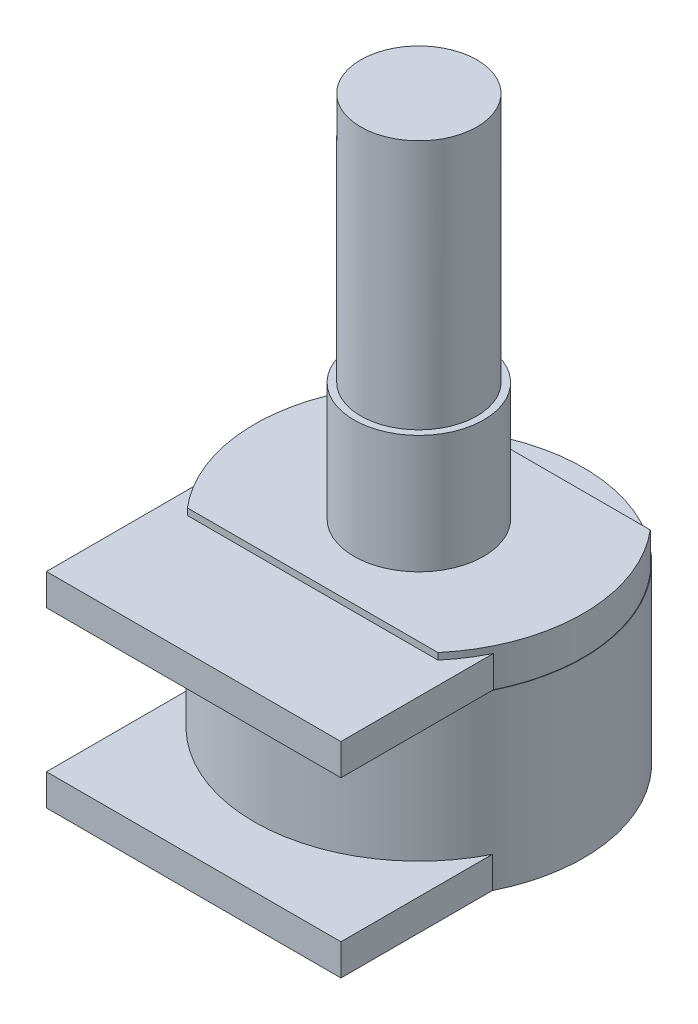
ISO-10303-21;
HEADER;
FILE_DESCRIPTION(('STEP AP214'),'2;1');
FILE_NAME('part.step','',(''),(''),'','','');
FILE_SCHEMA(('AUTOMOTIVE_DESIGN { 1 0 10303 214 1 1 1 1 }'));
ENDSEC;
DATA;
#1=APPLICATION_CONTEXT('core data for automotive mechanical design processes');
#2=APPLICATION_PROTOCOL_DEFINITION('international standard','automotive_design',2000,#1);
#3=PRODUCT_CONTEXT('',#1,'mechanical');
#4=PRODUCT('Part','Part','',(#3));
#5=PRODUCT_RELATED_PRODUCT_CATEGORY('part','',(#4));
#6=PRODUCT_DEFINITION_FORMATION('','',#4);
#7=PRODUCT_DEFINITION_CONTEXT('part definition',#1,'design');
#8=PRODUCT_DEFINITION('design','',#6,#7);
#9=PRODUCT_DEFINITION_SHAPE('','',#8);
#10=(LENGTH_UNIT() NAMED_UNIT(*) SI_UNIT(.MILLI.,.METRE.));
#11=(NAMED_UNIT(*) PLANE_ANGLE_UNIT() SI_UNIT($,.RADIAN.));
#12=(NAMED_UNIT(*) SI_UNIT($,.STERADIAN.) SOLID_ANGLE_UNIT());
#13=UNCERTAINTY_MEASURE_WITH_UNIT(LENGTH_MEASURE(1.E-05),#10,'distance_accuracy_value','');
#14=(GEOMETRIC_REPRESENTATION_CONTEXT(3) GLOBAL_UNCERTAINTY_ASSIGNED_CONTEXT((#13)) GLOBAL_UNIT_ASSIGNED_CONTEXT((#10,
#11,#12)) REPRESENTATION_CONTEXT('',''));
#15=CARTESIAN_POINT('',(0.,0.,0.));
#16=DIRECTION('',(0.,0.,1.));
#17=DIRECTION('',(1.,0.,0.));
#18=AXIS2_PLACEMENT_3D('',#15,#16,#17);
#19=CARTESIAN_POINT('',(0.,-8.06,0.));
#20=DIRECTION('',(0.,1.,0.));
#21=DIRECTION('',(0.,0.,1.));
#22=AXIS2_PLACEMENT_3D('',#19,#20,#21);
#23=CYLINDRICAL_SURFACE('',#22,8.475);
#24=DIRECTION('',(0.,1.,0.));
#25=VECTOR('',#24,1.);
#26=CARTESIAN_POINT('',(-7.6,-8.06,3.7504166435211));
#27=LINE('',#26,#25);
#28=CARTESIAN_POINT('',(-7.6,-6.44,3.7504166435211));
#29=VERTEX_POINT('',#28);
#30=CARTESIAN_POINT('',(-7.6,-8.06,3.7504166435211));
#31=VERTEX_POINT('',#30);
#32=EDGE_CURVE('E184',#29,#31,#27,.F.);
#33=ORIENTED_EDGE('',*,*,#32,.F.);
#34=CARTESIAN_POINT('',(0.,-6.44,0.));
#35=DIRECTION('',(0.,1.,0.));
#36=DIRECTION('',(0.,0.,1.));
#37=AXIS2_PLACEMENT_3D('',#34,#35,#36);
#38=CIRCLE('',#37,8.475);
#39=CARTESIAN_POINT('',(-6.4649226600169,-6.44,5.48));
#40=VERTEX_POINT('',#39);
#41=EDGE_CURVE('E192',#29,#40,#38,.T.);
#42=ORIENTED_EDGE('',*,*,#41,.T.);
#43=DIRECTION('',(0.,1.,0.));
#44=VECTOR('',#43,1.);
#45=CARTESIAN_POINT('',(-6.4649226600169,-8.06,5.48));
#46=LINE('',#45,#44);
#47=CARTESIAN_POINT('',(-6.4649226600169,-6.1,5.48));
#48=VERTEX_POINT('',#47);
#49=EDGE_CURVE('E201',#48,#40,#46,.F.);
#50=ORIENTED_EDGE('',*,*,#49,.F.);
#51=CARTESIAN_POINT('',(0.,-6.1,0.));
#52=DIRECTION('',(0.,-1.,0.));
#53=DIRECTION('',(0.,0.,-1.));
#54=AXIS2_PLACEMENT_3D('',#51,#52,#53);
#55=CIRCLE('',#54,8.475);
#56=CARTESIAN_POINT('',(-6.4649226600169,-6.1,-5.48));
#57=VERTEX_POINT('',#56);
#58=EDGE_CURVE('E211',#48,#57,#55,.T.);
#59=ORIENTED_EDGE('',*,*,#58,.T.);
#60=DIRECTION('',(0.,1.,0.));
#61=VECTOR('',#60,1.);
#62=CARTESIAN_POINT('',(-6.4649226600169,-8.06,-5.48));
#63=LINE('',#62,#61);
#64=CARTESIAN_POINT('',(-6.4649226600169,-8.06,-5.48));
#65=VERTEX_POINT('',#64);
#66=EDGE_CURVE('E209',#65,#57,#63,.T.);
#67=ORIENTED_EDGE('',*,*,#66,.F.);
#68=CARTESIAN_POINT('',(0.,-8.06,0.));
#69=DIRECTION('',(0.,-1.,0.));
#70=DIRECTION('',(0.,0.,-1.));
#71=AXIS2_PLACEMENT_3D('',#68,#69,#70);
#72=CIRCLE('',#71,8.475);
#73=EDGE_CURVE('E216',#31,#65,#72,.T.);
#74=ORIENTED_EDGE('',*,*,#73,.F.);
#75=EDGE_LOOP('',(#33,#42,#50,#59,#67,#74));
#76=FACE_BOUND('',#75,.T.);
#77=ADVANCED_FACE('F37',(#76),#23,.T.);
#78=DIRECTION('',(0.,1.,0.));
#79=VECTOR('',#78,1.);
#80=CARTESIAN_POINT('',(7.6,-8.06,3.75041664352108));
#81=LINE('',#80,#79);
#82=CARTESIAN_POINT('',(7.6,-8.06,3.75041664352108));
#83=VERTEX_POINT('',#82);
#84=CARTESIAN_POINT('',(7.6,-6.44,3.75041664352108));
#85=VERTEX_POINT('',#84);
#86=EDGE_CURVE('E187',#83,#85,#81,.T.);
#87=ORIENTED_EDGE('',*,*,#86,.F.);
#88=CARTESIAN_POINT('',(6.46492266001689,-8.06,-5.48));
#89=VERTEX_POINT('',#88);
#90=EDGE_CURVE('E212',#89,#83,#72,.T.);
#91=ORIENTED_EDGE('',*,*,#90,.F.);
#92=DIRECTION('',(0.,1.,0.));
#93=VECTOR('',#92,1.);
#94=CARTESIAN_POINT('',(6.4649226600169,-8.06,-5.48));
#95=LINE('',#94,#93);
#96=CARTESIAN_POINT('',(6.4649226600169,-6.1,-5.48));
#97=VERTEX_POINT('',#96);
#98=EDGE_CURVE('E206',#97,#89,#95,.F.);
#99=ORIENTED_EDGE('',*,*,#98,.F.);
#100=CARTESIAN_POINT('',(6.4649226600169,-6.1,5.48));
#101=VERTEX_POINT('',#100);
#102=EDGE_CURVE('E217',#97,#101,#55,.T.);
#103=ORIENTED_EDGE('',*,*,#102,.T.);
#104=DIRECTION('',(0.,1.,0.));
#105=VECTOR('',#104,1.);
#106=CARTESIAN_POINT('',(6.4649226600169,-8.06,5.48));
#107=LINE('',#106,#105);
#108=CARTESIAN_POINT('',(6.4649226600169,-6.44,5.48));
#109=VERTEX_POINT('',#108);
#110=EDGE_CURVE('E204',#109,#101,#107,.T.);
#111=ORIENTED_EDGE('',*,*,#110,.F.);
#112=CARTESIAN_POINT('',(0.,-6.44,0.));
#113=DIRECTION('',(0.,1.,0.));
#114=DIRECTION('',(0.,0.,1.));
#115=AXIS2_PLACEMENT_3D('',#112,#113,#114);
#116=CIRCLE('',#115,8.475);
#117=EDGE_CURVE('E190',#109,#85,#116,.T.);
#118=ORIENTED_EDGE('',*,*,#117,.T.);
#119=EDGE_LOOP('',(#87,#91,#99,#103,#111,#118));
#120=FACE_BOUND('',#119,.T.);
#121=ADVANCED_FACE('F252',(#120),#23,.T.);
#122=CARTESIAN_POINT('',(0.,-8.06,0.));
#123=DIRECTION('',(0.,-1.,0.));
#124=DIRECTION('',(0.,0.,-1.));
#125=AXIS2_PLACEMENT_3D('',#122,#123,#124);
#126=PLANE('',#125);
#127=DIRECTION('',(0.,0.,-1.));
#128=VECTOR('',#127,1.);
#129=CARTESIAN_POINT('',(7.6,-8.06,0.));
#130=LINE('',#129,#128);
#131=CARTESIAN_POINT('',(7.6,-8.06,3.80657326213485));
#132=VERTEX_POINT('',#131);
#133=EDGE_CURVE('E238',#132,#83,#130,.T.);
#134=ORIENTED_EDGE('',*,*,#133,.F.);
#135=CARTESIAN_POINT('',(0.,-8.06,0.));
#136=DIRECTION('',(0.,-1.,0.));
#137=DIRECTION('',(0.,0.,-1.));
#138=AXIS2_PLACEMENT_3D('',#135,#136,#137);
#139=CIRCLE('',#138,8.5);
#140=CARTESIAN_POINT('',(-7.6,-8.06,3.80657326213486));
#141=VERTEX_POINT('',#140);
#142=EDGE_CURVE('E194',#141,#132,#139,.T.);
#143=ORIENTED_EDGE('',*,*,#142,.F.);
#144=DIRECTION('',(0.,0.,1.));
#145=VECTOR('',#144,1.);
#146=CARTESIAN_POINT('',(-7.6,-8.06,0.));
#147=LINE('',#146,#145);
#148=EDGE_CURVE('E235',#31,#141,#147,.T.);
#149=ORIENTED_EDGE('',*,*,#148,.F.);
#150=ORIENTED_EDGE('',*,*,#73,.T.);
#151=DIRECTION('',(1.,0.,0.));
#152=VECTOR('',#151,1.);
#153=CARTESIAN_POINT('',(-11.8716242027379,-8.06,-5.48));
#154=LINE('',#153,#152);
#155=EDGE_CURVE('E196',#65,#89,#154,.T.);
#156=ORIENTED_EDGE('',*,*,#155,.T.);
#157=ORIENTED_EDGE('',*,*,#90,.T.);
#158=EDGE_LOOP('',(#134,#143,#149,#150,#156,#157));
#159=FACE_BOUND('',#158,.T.);
#160=ADVANCED_FACE('F276',(#159),#126,.F.);
#161=CARTESIAN_POINT('',(0.,-6.1,0.));
#162=DIRECTION('',(0.,-1.,0.));
#163=DIRECTION('',(0.,0.,-1.));
#164=AXIS2_PLACEMENT_3D('',#161,#162,#163);
#165=PLANE('',#164);
#166=CARTESIAN_POINT('',(0.,-6.1,0.));
#167=DIRECTION('',(0.,-1.,0.));
#168=DIRECTION('',(0.,0.,-1.));
#169=AXIS2_PLACEMENT_3D('',#166,#167,#168);
#170=CIRCLE('',#169,3.35);
#171=CARTESIAN_POINT('',(0.,-6.1,-3.35));
#172=VERTEX_POINT('',#171);
#173=EDGE_CURVE('E220',#172,#172,#170,.T.);
#174=ORIENTED_EDGE('',*,*,#173,.T.);
#175=EDGE_LOOP('',(#174));
#176=FACE_BOUND('',#175,.T.);
#177=DIRECTION('',(1.,0.,0.));
#178=VECTOR('',#177,1.);
#179=CARTESIAN_POINT('',(0.,-6.1,-5.48));
#180=LINE('',#179,#178);
#181=EDGE_CURVE('E233',#57,#97,#180,.T.);
#182=ORIENTED_EDGE('',*,*,#181,.F.);
#183=ORIENTED_EDGE('',*,*,#58,.F.);
#184=DIRECTION('',(-1.,0.,0.));
#185=VECTOR('',#184,1.);
#186=CARTESIAN_POINT('',(0.,-6.1,5.48));
#187=LINE('',#186,#185);
#188=EDGE_CURVE('E231',#101,#48,#187,.T.);
#189=ORIENTED_EDGE('',*,*,#188,.F.);
#190=ORIENTED_EDGE('',*,*,#102,.F.);
#191=EDGE_LOOP('',(#182,#183,#189,#190));
#192=FACE_BOUND('',#191,.T.);
#193=ADVANCED_FACE('F257',(#176,#192),#165,.F.);
#194=CARTESIAN_POINT('',(0.,12.92,0.));
#195=DIRECTION('',(0.,-1.,0.));
#196=DIRECTION('',(0.,0.,-1.));
#197=AXIS2_PLACEMENT_3D('',#194,#195,#196);
#198=CYLINDRICAL_SURFACE('',#197,3.);
#199=CARTESIAN_POINT('',(0.,12.92,0.));
#200=DIRECTION('',(0.,1.,0.));
#201=DIRECTION('',(0.,0.,1.));
#202=AXIS2_PLACEMENT_3D('',#199,#200,#201);
#203=CIRCLE('',#202,3.);
#204=CARTESIAN_POINT('',(0.,12.92,3.));
#205=VERTEX_POINT('',#204);
#206=EDGE_CURVE('E228',#205,#205,#203,.T.);
#207=ORIENTED_EDGE('',*,*,#206,.F.);
#208=EDGE_LOOP('',(#207));
#209=FACE_BOUND('',#208,.T.);
#210=CARTESIAN_POINT('',(0.,0.,0.));
#211=DIRECTION('',(0.,-1.,0.));
#212=DIRECTION('',(0.,0.,-1.));
#213=AXIS2_PLACEMENT_3D('',#210,#211,#212);
#214=CIRCLE('',#213,3.);
#215=CARTESIAN_POINT('',(0.,0.,-3.));
#216=VERTEX_POINT('',#215);
#217=EDGE_CURVE('E223',#216,#216,#214,.T.);
#218=ORIENTED_EDGE('',*,*,#217,.F.);
#219=EDGE_LOOP('',(#218));
#220=FACE_BOUND('',#219,.T.);
#221=ADVANCED_FACE('F39',(#209,#220),#198,.T.);
#222=CARTESIAN_POINT('',(0.,12.92,0.));
#223=DIRECTION('',(0.,1.,0.));
#224=DIRECTION('',(0.,0.,1.));
#225=AXIS2_PLACEMENT_3D('',#222,#223,#224);
#226=PLANE('',#225);
#227=ORIENTED_EDGE('',*,*,#206,.T.);
#228=EDGE_LOOP('',(#227));
#229=FACE_BOUND('',#228,.T.);
#230=ADVANCED_FACE('F304',(#229),#226,.T.);
#231=CARTESIAN_POINT('',(0.,-6.1,0.));
#232=DIRECTION('',(0.,1.,0.));
#233=DIRECTION('',(0.,0.,1.));
#234=AXIS2_PLACEMENT_3D('',#231,#232,#233);
#235=CYLINDRICAL_SURFACE('',#234,3.35);
#236=ORIENTED_EDGE('',*,*,#173,.F.);
#237=EDGE_LOOP('',(#236));
#238=FACE_BOUND('',#237,.T.);
#239=CARTESIAN_POINT('',(0.,0.,0.));
#240=DIRECTION('',(0.,-1.,0.));
#241=DIRECTION('',(0.,0.,-1.));
#242=AXIS2_PLACEMENT_3D('',#239,#240,#241);
#243=CIRCLE('',#242,3.35);
#244=CARTESIAN_POINT('',(0.,0.,-3.35));
#245=VERTEX_POINT('',#244);
#246=EDGE_CURVE('E215',#245,#245,#243,.T.);
#247=ORIENTED_EDGE('',*,*,#246,.T.);
#248=EDGE_LOOP('',(#247));
#249=FACE_BOUND('',#248,.T.);
#250=ADVANCED_FACE('F301',(#238,#249),#235,.T.);
#251=CARTESIAN_POINT('',(0.,0.,0.));
#252=DIRECTION('',(0.,-1.,0.));
#253=DIRECTION('',(0.,0.,-1.));
#254=AXIS2_PLACEMENT_3D('',#251,#252,#253);
#255=PLANE('',#254);
#256=ORIENTED_EDGE('',*,*,#217,.T.);
#257=EDGE_LOOP('',(#256));
#258=FACE_BOUND('',#257,.T.);
#259=ORIENTED_EDGE('',*,*,#246,.F.);
#260=EDGE_LOOP('',(#259));
#261=FACE_BOUND('',#260,.T.);
#262=ADVANCED_FACE('F290',(#258,#261),#255,.F.);
#263=CARTESIAN_POINT('',(-11.8716242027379,-6.1,5.48));
#264=DIRECTION('',(0.,0.,1.));
#265=DIRECTION('',(1.,0.,0.));
#266=AXIS2_PLACEMENT_3D('',#263,#264,#265);
#267=PLANE('',#266);
#268=DIRECTION('',(-1.,0.,0.));
#269=VECTOR('',#268,1.);
#270=CARTESIAN_POINT('',(-11.8716242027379,-6.44,5.48));
#271=LINE('',#270,#269);
#272=EDGE_CURVE('E45',#109,#40,#271,.T.);
#273=ORIENTED_EDGE('',*,*,#272,.F.);
#274=ORIENTED_EDGE('',*,*,#110,.T.);
#275=ORIENTED_EDGE('',*,*,#188,.T.);
#276=ORIENTED_EDGE('',*,*,#49,.T.);
#277=EDGE_LOOP('',(#273,#274,#275,#276));
#278=FACE_BOUND('',#277,.T.);
#279=ADVANCED_FACE('F248',(#278),#267,.T.);
#280=CARTESIAN_POINT('',(-11.8716242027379,-6.1,-5.48));
#281=DIRECTION('',(0.,0.,-1.));
#282=DIRECTION('',(-1.,0.,0.));
#283=AXIS2_PLACEMENT_3D('',#280,#281,#282);
#284=PLANE('',#283);
#285=ORIENTED_EDGE('',*,*,#66,.T.);
#286=ORIENTED_EDGE('',*,*,#181,.T.);
#287=ORIENTED_EDGE('',*,*,#98,.T.);
#288=ORIENTED_EDGE('',*,*,#155,.F.);
#289=EDGE_LOOP('',(#285,#286,#287,#288));
#290=FACE_BOUND('',#289,.T.);
#291=ADVANCED_FACE('F281',(#290),#284,.T.);
#292=CARTESIAN_POINT('',(0.,-17.01,0.));
#293=DIRECTION('',(0.,1.,0.));
#294=DIRECTION('',(0.,0.,1.));
#295=AXIS2_PLACEMENT_3D('',#292,#293,#294);
#296=CYLINDRICAL_SURFACE('',#295,8.5);
#297=CARTESIAN_POINT('',(0.,-15.39,0.));
#298=DIRECTION('',(0.,-1.,0.));
#299=DIRECTION('',(0.,0.,-1.));
#300=AXIS2_PLACEMENT_3D('',#297,#298,#299);
#301=CIRCLE('',#300,8.5);
#302=CARTESIAN_POINT('',(7.6,-15.39,3.80657326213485));
#303=VERTEX_POINT('',#302);
#304=CARTESIAN_POINT('',(-7.6,-15.39,3.80657326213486));
#305=VERTEX_POINT('',#304);
#306=EDGE_CURVE('E12',#303,#305,#301,.T.);
#307=ORIENTED_EDGE('',*,*,#306,.F.);
#308=DIRECTION('',(0.,1.,0.));
#309=VECTOR('',#308,1.);
#310=CARTESIAN_POINT('',(7.6,-17.01,3.80657326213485));
#311=LINE('',#310,#309);
#312=CARTESIAN_POINT('',(7.6,-17.01,3.80657326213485));
#313=VERTEX_POINT('',#312);
#314=EDGE_CURVE('E162',#303,#313,#311,.F.);
#315=ORIENTED_EDGE('',*,*,#314,.T.);
#316=CARTESIAN_POINT('',(0.,-17.01,0.));
#317=DIRECTION('',(0.,-1.,0.));
#318=DIRECTION('',(0.,0.,-1.));
#319=AXIS2_PLACEMENT_3D('',#316,#317,#318);
#320=CIRCLE('',#319,8.5);
#321=CARTESIAN_POINT('',(-7.6,-17.01,3.80657326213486));
#322=VERTEX_POINT('',#321);
#323=EDGE_CURVE('E55',#322,#313,#320,.T.);
#324=ORIENTED_EDGE('',*,*,#323,.F.);
#325=DIRECTION('',(0.,1.,0.));
#326=VECTOR('',#325,1.);
#327=CARTESIAN_POINT('',(-7.6,-17.01,3.80657326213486));
#328=LINE('',#327,#326);
#329=EDGE_CURVE('E139',#322,#305,#328,.T.);
#330=ORIENTED_EDGE('',*,*,#329,.T.);
#331=EDGE_LOOP('',(#307,#315,#324,#330));
#332=FACE_BOUND('',#331,.T.);
#333=EDGE_CURVE('E197',#132,#141,#139,.T.);
#334=ORIENTED_EDGE('',*,*,#333,.T.);
#335=ORIENTED_EDGE('',*,*,#142,.T.);
#336=EDGE_LOOP('',(#334,#335));
#337=FACE_BOUND('',#336,.T.);
#338=ADVANCED_FACE('F283',(#332,#337),#296,.T.);
#339=CARTESIAN_POINT('',(0.,-17.01,0.));
#340=DIRECTION('',(0.,-1.,0.));
#341=DIRECTION('',(0.,0.,-1.));
#342=AXIS2_PLACEMENT_3D('',#339,#340,#341);
#343=PLANE('',#342);
#344=ORIENTED_EDGE('',*,*,#323,.T.);
#345=DIRECTION('',(0.,0.,-1.));
#346=VECTOR('',#345,1.);
#347=CARTESIAN_POINT('',(7.6,-17.01,0.223339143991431));
#348=LINE('',#347,#346);
#349=CARTESIAN_POINT('',(7.60000000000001,-17.01,11.62));
#350=VERTEX_POINT('',#349);
#351=EDGE_CURVE('E132',#350,#313,#348,.T.);
#352=ORIENTED_EDGE('',*,*,#351,.F.);
#353=DIRECTION('',(1.,0.,0.));
#354=VECTOR('',#353,1.);
#355=CARTESIAN_POINT('',(-7.59999999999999,-17.01,11.62));
#356=LINE('',#355,#354);
#357=CARTESIAN_POINT('',(-7.59999999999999,-17.01,11.62));
#358=VERTEX_POINT('',#357);
#359=EDGE_CURVE('E146',#358,#350,#356,.T.);
#360=ORIENTED_EDGE('',*,*,#359,.F.);
#361=DIRECTION('',(0.,0.,1.));
#362=VECTOR('',#361,1.);
#363=CARTESIAN_POINT('',(-7.6,-17.01,0.223339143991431));
#364=LINE('',#363,#362);
#365=EDGE_CURVE('E152',#322,#358,#364,.T.);
#366=ORIENTED_EDGE('',*,*,#365,.F.);
#367=EDGE_LOOP('',(#344,#352,#360,#366));
#368=FACE_BOUND('',#367,.T.);
#369=ADVANCED_FACE('F144',(#368),#343,.T.);
#370=CARTESIAN_POINT('',(0.,-6.44,0.));
#371=DIRECTION('',(0.,1.,0.));
#372=DIRECTION('',(0.,0.,1.));
#373=AXIS2_PLACEMENT_3D('',#370,#371,#372);
#374=PLANE('',#373);
#375=ORIENTED_EDGE('',*,*,#41,.F.);
#376=DIRECTION('',(0.,0.,1.));
#377=VECTOR('',#376,1.);
#378=CARTESIAN_POINT('',(-7.6,-6.44,0.223339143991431));
#379=LINE('',#378,#377);
#380=CARTESIAN_POINT('',(-7.59999999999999,-6.44,11.62));
#381=VERTEX_POINT('',#380);
#382=EDGE_CURVE('E168',#29,#381,#379,.T.);
#383=ORIENTED_EDGE('',*,*,#382,.T.);
#384=DIRECTION('',(1.,0.,0.));
#385=VECTOR('',#384,1.);
#386=CARTESIAN_POINT('',(-7.59999999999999,-6.44,11.62));
#387=LINE('',#386,#385);
#388=CARTESIAN_POINT('',(7.60000000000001,-6.44,11.62));
#389=VERTEX_POINT('',#388);
#390=EDGE_CURVE('E171',#381,#389,#387,.T.);
#391=ORIENTED_EDGE('',*,*,#390,.T.);
#392=DIRECTION('',(0.,0.,-1.));
#393=VECTOR('',#392,1.);
#394=CARTESIAN_POINT('',(7.6,-6.44,0.223339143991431));
#395=LINE('',#394,#393);
#396=EDGE_CURVE('E165',#389,#85,#395,.T.);
#397=ORIENTED_EDGE('',*,*,#396,.T.);
#398=ORIENTED_EDGE('',*,*,#117,.F.);
#399=ORIENTED_EDGE('',*,*,#272,.T.);
#400=EDGE_LOOP('',(#375,#383,#391,#397,#398,#399));
#401=FACE_BOUND('',#400,.T.);
#402=ADVANCED_FACE('F244',(#401),#374,.T.);
#403=CARTESIAN_POINT('',(7.6,-6.44,0.223339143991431));
#404=DIRECTION('',(-1.,0.,0.));
#405=DIRECTION('',(0.,0.,1.));
#406=AXIS2_PLACEMENT_3D('',#403,#404,#405);
#407=PLANE('',#406);
#408=ORIENTED_EDGE('',*,*,#133,.T.);
#409=ORIENTED_EDGE('',*,*,#86,.T.);
#410=ORIENTED_EDGE('',*,*,#396,.F.);
#411=DIRECTION('',(0.,-1.,0.));
#412=VECTOR('',#411,1.);
#413=CARTESIAN_POINT('',(7.60000000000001,-6.44,11.62));
#414=LINE('',#413,#412);
#415=CARTESIAN_POINT('',(7.60000000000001,-8.06,11.62));
#416=VERTEX_POINT('',#415);
#417=EDGE_CURVE('E173',#389,#416,#414,.T.);
#418=ORIENTED_EDGE('',*,*,#417,.T.);
#419=DIRECTION('',(0.,0.,-1.));
#420=VECTOR('',#419,1.);
#421=CARTESIAN_POINT('',(7.6,-8.06,0.223339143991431));
#422=LINE('',#421,#420);
#423=EDGE_CURVE('E164',#416,#132,#422,.T.);
#424=ORIENTED_EDGE('',*,*,#423,.T.);
#425=EDGE_LOOP('',(#408,#409,#410,#418,#424));
#426=FACE_BOUND('',#425,.T.);
#427=ADVANCED_FACE('F274',(#426),#407,.F.);
#428=CARTESIAN_POINT('',(-7.6,-6.44,0.223339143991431));
#429=DIRECTION('',(1.,0.,0.));
#430=DIRECTION('',(0.,0.,-1.));
#431=AXIS2_PLACEMENT_3D('',#428,#429,#430);
#432=PLANE('',#431);
#433=ORIENTED_EDGE('',*,*,#382,.F.);
#434=ORIENTED_EDGE('',*,*,#32,.T.);
#435=ORIENTED_EDGE('',*,*,#148,.T.);
#436=DIRECTION('',(0.,0.,1.));
#437=VECTOR('',#436,1.);
#438=CARTESIAN_POINT('',(-7.6,-8.06,0.223339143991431));
#439=LINE('',#438,#437);
#440=CARTESIAN_POINT('',(-7.59999999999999,-8.06,11.62));
#441=VERTEX_POINT('',#440);
#442=EDGE_CURVE('E176',#141,#441,#439,.T.);
#443=ORIENTED_EDGE('',*,*,#442,.T.);
#444=DIRECTION('',(0.,-1.,0.));
#445=VECTOR('',#444,1.);
#446=CARTESIAN_POINT('',(-7.59999999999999,-6.44,11.62));
#447=LINE('',#446,#445);
#448=EDGE_CURVE('E181',#381,#441,#447,.T.);
#449=ORIENTED_EDGE('',*,*,#448,.F.);
#450=EDGE_LOOP('',(#433,#434,#435,#443,#449));
#451=FACE_BOUND('',#450,.T.);
#452=ADVANCED_FACE('F264',(#451),#432,.F.);
#453=CARTESIAN_POINT('',(-7.59999999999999,-6.44,11.62));
#454=DIRECTION('',(0.,0.,-1.));
#455=DIRECTION('',(-1.,0.,0.));
#456=AXIS2_PLACEMENT_3D('',#453,#454,#455);
#457=PLANE('',#456);
#458=DIRECTION('',(1.,0.,0.));
#459=VECTOR('',#458,1.);
#460=CARTESIAN_POINT('',(-7.59999999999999,-8.06,11.62));
#461=LINE('',#460,#459);
#462=EDGE_CURVE('E169',#441,#416,#461,.T.);
#463=ORIENTED_EDGE('',*,*,#462,.T.);
#464=ORIENTED_EDGE('',*,*,#417,.F.);
#465=ORIENTED_EDGE('',*,*,#390,.F.);
#466=ORIENTED_EDGE('',*,*,#448,.T.);
#467=EDGE_LOOP('',(#463,#464,#465,#466));
#468=FACE_BOUND('',#467,.T.);
#469=ADVANCED_FACE('F270',(#468),#457,.F.);
#470=CARTESIAN_POINT('',(0.,-8.06,0.));
#471=DIRECTION('',(0.,1.,0.));
#472=DIRECTION('',(0.,0.,1.));
#473=AXIS2_PLACEMENT_3D('',#470,#471,#472);
#474=PLANE('',#473);
#475=ORIENTED_EDGE('',*,*,#442,.F.);
#476=ORIENTED_EDGE('',*,*,#333,.F.);
#477=ORIENTED_EDGE('',*,*,#423,.F.);
#478=ORIENTED_EDGE('',*,*,#462,.F.);
#479=EDGE_LOOP('',(#475,#476,#477,#478));
#480=FACE_BOUND('',#479,.T.);
#481=ADVANCED_FACE('F338',(#480),#474,.F.);
#482=CARTESIAN_POINT('',(7.6,-17.01,0.223339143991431));
#483=DIRECTION('',(1.,0.,0.));
#484=DIRECTION('',(0.,0.,-1.));
#485=AXIS2_PLACEMENT_3D('',#482,#483,#484);
#486=PLANE('',#485);
#487=ORIENTED_EDGE('',*,*,#314,.F.);
#488=DIRECTION('',(0.,0.,-1.));
#489=VECTOR('',#488,1.);
#490=CARTESIAN_POINT('',(7.6,-15.39,0.223339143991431));
#491=LINE('',#490,#489);
#492=CARTESIAN_POINT('',(7.60000000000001,-15.39,11.62));
#493=VERTEX_POINT('',#492);
#494=EDGE_CURVE('E134',#493,#303,#491,.T.);
#495=ORIENTED_EDGE('',*,*,#494,.F.);
#496=DIRECTION('',(0.,1.,0.));
#497=VECTOR('',#496,1.);
#498=CARTESIAN_POINT('',(7.60000000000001,-17.01,11.62));
#499=LINE('',#498,#497);
#500=EDGE_CURVE('E129',#350,#493,#499,.T.);
#501=ORIENTED_EDGE('',*,*,#500,.F.);
#502=ORIENTED_EDGE('',*,*,#351,.T.);
#503=EDGE_LOOP('',(#487,#495,#501,#502));
#504=FACE_BOUND('',#503,.T.);
#505=ADVANCED_FACE('F131',(#504),#486,.T.);
#506=CARTESIAN_POINT('',(-7.6,-17.01,0.223339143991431));
#507=DIRECTION('',(-1.,0.,0.));
#508=DIRECTION('',(0.,0.,1.));
#509=AXIS2_PLACEMENT_3D('',#506,#507,#508);
#510=PLANE('',#509);
#511=ORIENTED_EDGE('',*,*,#329,.F.);
#512=ORIENTED_EDGE('',*,*,#365,.T.);
#513=DIRECTION('',(0.,1.,0.));
#514=VECTOR('',#513,1.);
#515=CARTESIAN_POINT('',(-7.59999999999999,-17.01,11.62));
#516=LINE('',#515,#514);
#517=CARTESIAN_POINT('',(-7.59999999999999,-15.39,11.62));
#518=VERTEX_POINT('',#517);
#519=EDGE_CURVE('E140',#358,#518,#516,.T.);
#520=ORIENTED_EDGE('',*,*,#519,.T.);
#521=DIRECTION('',(0.,0.,1.));
#522=VECTOR('',#521,1.);
#523=CARTESIAN_POINT('',(-7.6,-15.39,0.223339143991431));
#524=LINE('',#523,#522);
#525=EDGE_CURVE('E147',#305,#518,#524,.T.);
#526=ORIENTED_EDGE('',*,*,#525,.F.);
#527=EDGE_LOOP('',(#511,#512,#520,#526));
#528=FACE_BOUND('',#527,.T.);
#529=ADVANCED_FACE('F346',(#528),#510,.T.);
#530=CARTESIAN_POINT('',(-7.59999999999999,-17.01,11.62));
#531=DIRECTION('',(0.,0.,1.));
#532=DIRECTION('',(1.,0.,0.));
#533=AXIS2_PLACEMENT_3D('',#530,#531,#532);
#534=PLANE('',#533);
#535=DIRECTION('',(1.,0.,0.));
#536=VECTOR('',#535,1.);
#537=CARTESIAN_POINT('',(-7.59999999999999,-15.39,11.62));
#538=LINE('',#537,#536);
#539=EDGE_CURVE('E157',#518,#493,#538,.T.);
#540=ORIENTED_EDGE('',*,*,#539,.F.);
#541=ORIENTED_EDGE('',*,*,#519,.F.);
#542=ORIENTED_EDGE('',*,*,#359,.T.);
#543=ORIENTED_EDGE('',*,*,#500,.T.);
#544=EDGE_LOOP('',(#540,#541,#542,#543));
#545=FACE_BOUND('',#544,.T.);
#546=ADVANCED_FACE('F150',(#545),#534,.T.);
#547=CARTESIAN_POINT('',(0.,-15.39,0.));
#548=DIRECTION('',(0.,-1.,0.));
#549=DIRECTION('',(0.,0.,1.));
#550=AXIS2_PLACEMENT_3D('',#547,#548,#549);
#551=PLANE('',#550);
#552=ORIENTED_EDGE('',*,*,#494,.T.);
#553=ORIENTED_EDGE('',*,*,#306,.T.);
#554=ORIENTED_EDGE('',*,*,#525,.T.);
#555=ORIENTED_EDGE('',*,*,#539,.T.);
#556=EDGE_LOOP('',(#552,#553,#554,#555));
#557=FACE_BOUND('',#556,.T.);
#558=ADVANCED_FACE('F349',(#557),#551,.F.);
#559=CLOSED_SHELL('',(#77,#121,#160,#193,#221,#230,#250,#262,#279,#291,#338,#369,#402,#427,#452,
#469,#481,#505,#529,#546,#558));
#560=MANIFOLD_SOLID_BREP('B2',#559);
#561=ADVANCED_BREP_SHAPE_REPRESENTATION('',(#18,#560),#14);
#562=SHAPE_DEFINITION_REPRESENTATION(#9,#561);
ENDSEC;
END-ISO-10303-21;
